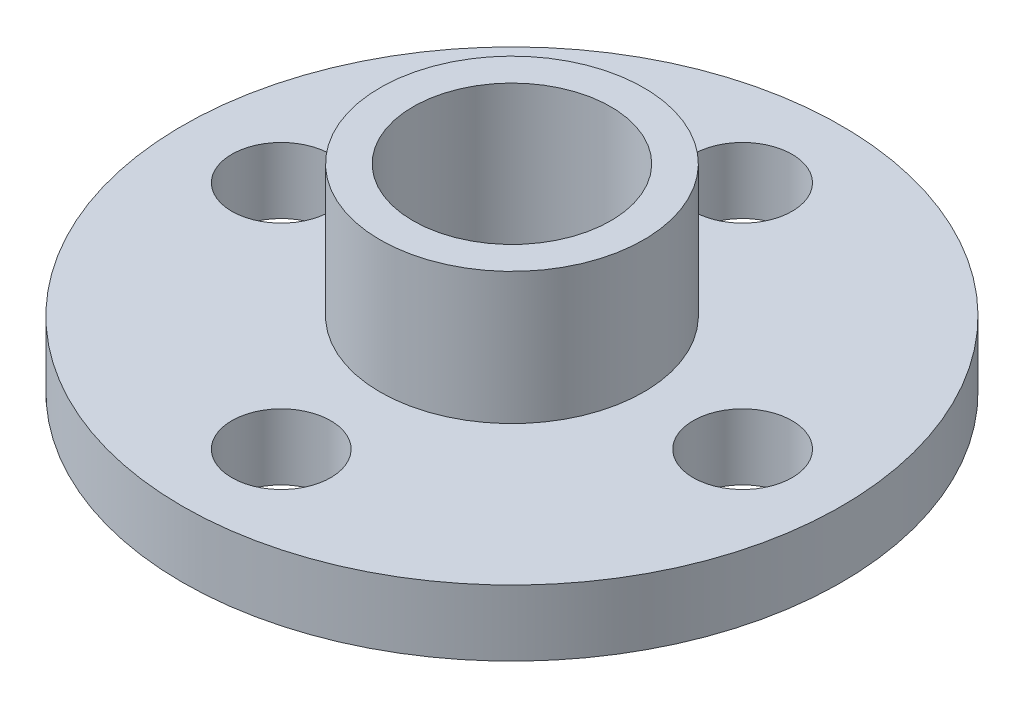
ISO-10303-21;
HEADER;
FILE_DESCRIPTION(('STEP AP214'),'2;1');
FILE_NAME('part.step','',(''),(''),'','','');
FILE_SCHEMA(('AUTOMOTIVE_DESIGN { 1 0 10303 214 1 1 1 1 }'));
ENDSEC;
DATA;
#1=APPLICATION_CONTEXT('core data for automotive mechanical design processes');
#2=APPLICATION_PROTOCOL_DEFINITION('international standard','automotive_design',2000,#1);
#3=PRODUCT_CONTEXT('',#1,'mechanical');
#4=PRODUCT('Part','Part','',(#3));
#5=PRODUCT_RELATED_PRODUCT_CATEGORY('part','',(#4));
#6=PRODUCT_DEFINITION_FORMATION('','',#4);
#7=PRODUCT_DEFINITION_CONTEXT('part definition',#1,'design');
#8=PRODUCT_DEFINITION('design','',#6,#7);
#9=PRODUCT_DEFINITION_SHAPE('','',#8);
#10=(LENGTH_UNIT() NAMED_UNIT(*) SI_UNIT(.MILLI.,.METRE.));
#11=(NAMED_UNIT(*) PLANE_ANGLE_UNIT() SI_UNIT($,.RADIAN.));
#12=(NAMED_UNIT(*) SI_UNIT($,.STERADIAN.) SOLID_ANGLE_UNIT());
#13=UNCERTAINTY_MEASURE_WITH_UNIT(LENGTH_MEASURE(1.E-05),#10,'distance_accuracy_value','');
#14=(GEOMETRIC_REPRESENTATION_CONTEXT(3) GLOBAL_UNCERTAINTY_ASSIGNED_CONTEXT((#13)) GLOBAL_UNIT_ASSIGNED_CONTEXT((#10,
#11,#12)) REPRESENTATION_CONTEXT('',''));
#15=CARTESIAN_POINT('',(0.,0.,0.));
#16=DIRECTION('',(0.,0.,1.));
#17=DIRECTION('',(1.,0.,0.));
#18=AXIS2_PLACEMENT_3D('',#15,#16,#17);
#19=CARTESIAN_POINT('',(0.,2.,0.));
#20=DIRECTION('',(0.,1.,0.));
#21=DIRECTION('',(0.,0.,1.));
#22=AXIS2_PLACEMENT_3D('',#19,#20,#21);
#23=PLANE('',#22);
#24=CARTESIAN_POINT('',(0.,2.,0.));
#25=DIRECTION('',(0.,1.,0.));
#26=DIRECTION('',(0.,0.,1.));
#27=AXIS2_PLACEMENT_3D('',#24,#25,#26);
#28=CIRCLE('',#27,4.);
#29=CARTESIAN_POINT('',(0.,2.,4.));
#30=VERTEX_POINT('',#29);
#31=EDGE_CURVE('E70',#30,#30,#28,.T.);
#32=ORIENTED_EDGE('',*,*,#31,.F.);
#33=EDGE_LOOP('',(#32));
#34=FACE_BOUND('',#33,.T.);
#35=CARTESIAN_POINT('',(4.23508953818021E-13,2.,7.));
#36=DIRECTION('',(0.,1.,0.));
#37=DIRECTION('',(0.,0.,1.));
#38=AXIS2_PLACEMENT_3D('',#35,#36,#37);
#39=CIRCLE('',#38,1.5);
#40=CARTESIAN_POINT('',(4.23508953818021E-13,2.,8.5));
#41=VERTEX_POINT('',#40);
#42=EDGE_CURVE('E55',#41,#41,#39,.T.);
#43=ORIENTED_EDGE('',*,*,#42,.F.);
#44=EDGE_LOOP('',(#43));
#45=FACE_BOUND('',#44,.T.);
#46=CARTESIAN_POINT('',(0.,2.,-7.));
#47=DIRECTION('',(0.,1.,0.));
#48=DIRECTION('',(0.,0.,1.));
#49=AXIS2_PLACEMENT_3D('',#46,#47,#48);
#50=CIRCLE('',#49,1.5);
#51=CARTESIAN_POINT('',(0.,2.,-5.5));
#52=VERTEX_POINT('',#51);
#53=EDGE_CURVE('E44',#52,#52,#50,.T.);
#54=ORIENTED_EDGE('',*,*,#53,.F.);
#55=EDGE_LOOP('',(#54));
#56=FACE_BOUND('',#55,.T.);
#57=CARTESIAN_POINT('',(0.,2.,0.));
#58=DIRECTION('',(0.,1.,0.));
#59=DIRECTION('',(0.,0.,1.));
#60=AXIS2_PLACEMENT_3D('',#57,#58,#59);
#61=CIRCLE('',#60,10.);
#62=CARTESIAN_POINT('',(0.,2.,10.));
#63=VERTEX_POINT('',#62);
#64=EDGE_CURVE('E10',#63,#63,#61,.T.);
#65=ORIENTED_EDGE('',*,*,#64,.T.);
#66=EDGE_LOOP('',(#65));
#67=FACE_BOUND('',#66,.T.);
#68=CARTESIAN_POINT('',(7.00000000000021,2.,-2.11754476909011E-13));
#69=DIRECTION('',(0.,1.,0.));
#70=DIRECTION('',(0.,0.,1.));
#71=AXIS2_PLACEMENT_3D('',#68,#69,#70);
#72=CIRCLE('',#71,1.5);
#73=CARTESIAN_POINT('',(7.00000000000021,2.,1.49999999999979));
#74=VERTEX_POINT('',#73);
#75=EDGE_CURVE('E49',#74,#74,#72,.T.);
#76=ORIENTED_EDGE('',*,*,#75,.F.);
#77=EDGE_LOOP('',(#76));
#78=FACE_BOUND('',#77,.T.);
#79=CARTESIAN_POINT('',(-6.99999999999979,2.,2.12611729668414E-13));
#80=DIRECTION('',(0.,1.,0.));
#81=DIRECTION('',(0.,0.,1.));
#82=AXIS2_PLACEMENT_3D('',#79,#80,#81);
#83=CIRCLE('',#82,1.5);
#84=CARTESIAN_POINT('',(-6.99999999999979,2.,1.50000000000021));
#85=VERTEX_POINT('',#84);
#86=EDGE_CURVE('E61',#85,#85,#83,.T.);
#87=ORIENTED_EDGE('',*,*,#86,.F.);
#88=EDGE_LOOP('',(#87));
#89=FACE_BOUND('',#88,.T.);
#90=ADVANCED_FACE('F31',(#34,#45,#56,#67,#78,#89),#23,.T.);
#91=CARTESIAN_POINT('',(0.,0.,0.));
#92=DIRECTION('',(0.,1.,0.));
#93=DIRECTION('',(0.,0.,1.));
#94=AXIS2_PLACEMENT_3D('',#91,#92,#93);
#95=PLANE('',#94);
#96=CARTESIAN_POINT('',(0.,0.,0.));
#97=DIRECTION('',(0.,1.,0.));
#98=DIRECTION('',(0.,0.,1.));
#99=AXIS2_PLACEMENT_3D('',#96,#97,#98);
#100=CIRCLE('',#99,3.);
#101=CARTESIAN_POINT('',(0.,0.,3.));
#102=VERTEX_POINT('',#101);
#103=EDGE_CURVE('E35',#102,#102,#100,.T.);
#104=ORIENTED_EDGE('',*,*,#103,.T.);
#105=EDGE_LOOP('',(#104));
#106=FACE_BOUND('',#105,.T.);
#107=CARTESIAN_POINT('',(0.,0.,0.));
#108=DIRECTION('',(0.,1.,0.));
#109=DIRECTION('',(0.,0.,1.));
#110=AXIS2_PLACEMENT_3D('',#107,#108,#109);
#111=CIRCLE('',#110,10.);
#112=CARTESIAN_POINT('',(0.,0.,10.));
#113=VERTEX_POINT('',#112);
#114=EDGE_CURVE('E39',#113,#113,#111,.T.);
#115=ORIENTED_EDGE('',*,*,#114,.F.);
#116=EDGE_LOOP('',(#115));
#117=FACE_BOUND('',#116,.T.);
#118=CARTESIAN_POINT('',(0.,0.,-7.));
#119=DIRECTION('',(0.,1.,0.));
#120=DIRECTION('',(0.,0.,1.));
#121=AXIS2_PLACEMENT_3D('',#118,#119,#120);
#122=CIRCLE('',#121,1.5);
#123=CARTESIAN_POINT('',(0.,0.,-5.5));
#124=VERTEX_POINT('',#123);
#125=EDGE_CURVE('E46',#124,#124,#122,.T.);
#126=ORIENTED_EDGE('',*,*,#125,.T.);
#127=EDGE_LOOP('',(#126));
#128=FACE_BOUND('',#127,.T.);
#129=CARTESIAN_POINT('',(7.00000000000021,0.,-2.11754476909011E-13));
#130=DIRECTION('',(0.,1.,0.));
#131=DIRECTION('',(0.,0.,1.));
#132=AXIS2_PLACEMENT_3D('',#129,#130,#131);
#133=CIRCLE('',#132,1.5);
#134=CARTESIAN_POINT('',(7.00000000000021,0.,1.49999999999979));
#135=VERTEX_POINT('',#134);
#136=EDGE_CURVE('E52',#135,#135,#133,.T.);
#137=ORIENTED_EDGE('',*,*,#136,.T.);
#138=EDGE_LOOP('',(#137));
#139=FACE_BOUND('',#138,.T.);
#140=CARTESIAN_POINT('',(4.23508953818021E-13,0.,7.));
#141=DIRECTION('',(0.,1.,0.));
#142=DIRECTION('',(0.,0.,1.));
#143=AXIS2_PLACEMENT_3D('',#140,#141,#142);
#144=CIRCLE('',#143,1.5);
#145=CARTESIAN_POINT('',(4.23508953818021E-13,0.,8.5));
#146=VERTEX_POINT('',#145);
#147=EDGE_CURVE('E58',#146,#146,#144,.T.);
#148=ORIENTED_EDGE('',*,*,#147,.T.);
#149=EDGE_LOOP('',(#148));
#150=FACE_BOUND('',#149,.T.);
#151=CARTESIAN_POINT('',(-6.99999999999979,0.,2.12611729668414E-13));
#152=DIRECTION('',(0.,1.,0.));
#153=DIRECTION('',(0.,0.,1.));
#154=AXIS2_PLACEMENT_3D('',#151,#152,#153);
#155=CIRCLE('',#154,1.5);
#156=CARTESIAN_POINT('',(-6.99999999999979,0.,1.50000000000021));
#157=VERTEX_POINT('',#156);
#158=EDGE_CURVE('E64',#157,#157,#155,.T.);
#159=ORIENTED_EDGE('',*,*,#158,.T.);
#160=EDGE_LOOP('',(#159));
#161=FACE_BOUND('',#160,.T.);
#162=ADVANCED_FACE('F82',(#106,#117,#128,#139,#150,#161),#95,.F.);
#163=CARTESIAN_POINT('',(0.,2.,0.));
#164=DIRECTION('',(0.,-1.,0.));
#165=DIRECTION('',(0.,0.,-1.));
#166=AXIS2_PLACEMENT_3D('',#163,#164,#165);
#167=CYLINDRICAL_SURFACE('',#166,10.);
#168=ORIENTED_EDGE('',*,*,#64,.F.);
#169=EDGE_LOOP('',(#168));
#170=FACE_BOUND('',#169,.T.);
#171=ORIENTED_EDGE('',*,*,#114,.T.);
#172=EDGE_LOOP('',(#171));
#173=FACE_BOUND('',#172,.T.);
#174=ADVANCED_FACE('F33',(#170,#173),#167,.T.);
#175=CARTESIAN_POINT('',(0.,2.,-7.));
#176=DIRECTION('',(0.,-1.,0.));
#177=DIRECTION('',(0.,0.,-1.));
#178=AXIS2_PLACEMENT_3D('',#175,#176,#177);
#179=CYLINDRICAL_SURFACE('',#178,1.5);
#180=ORIENTED_EDGE('',*,*,#53,.T.);
#181=EDGE_LOOP('',(#180));
#182=FACE_BOUND('',#181,.T.);
#183=ORIENTED_EDGE('',*,*,#125,.F.);
#184=EDGE_LOOP('',(#183));
#185=FACE_BOUND('',#184,.T.);
#186=ADVANCED_FACE('F105',(#182,#185),#179,.F.);
#187=CARTESIAN_POINT('',(7.00000000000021,2.,-2.11754476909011E-13));
#188=DIRECTION('',(0.,-1.,0.));
#189=DIRECTION('',(0.,0.,-1.));
#190=AXIS2_PLACEMENT_3D('',#187,#188,#189);
#191=CYLINDRICAL_SURFACE('',#190,1.5);
#192=ORIENTED_EDGE('',*,*,#75,.T.);
#193=EDGE_LOOP('',(#192));
#194=FACE_BOUND('',#193,.T.);
#195=ORIENTED_EDGE('',*,*,#136,.F.);
#196=EDGE_LOOP('',(#195));
#197=FACE_BOUND('',#196,.T.);
#198=ADVANCED_FACE('F108',(#194,#197),#191,.F.);
#199=CARTESIAN_POINT('',(4.23508953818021E-13,2.,7.));
#200=DIRECTION('',(0.,-1.,0.));
#201=DIRECTION('',(0.,0.,-1.));
#202=AXIS2_PLACEMENT_3D('',#199,#200,#201);
#203=CYLINDRICAL_SURFACE('',#202,1.5);
#204=ORIENTED_EDGE('',*,*,#42,.T.);
#205=EDGE_LOOP('',(#204));
#206=FACE_BOUND('',#205,.T.);
#207=ORIENTED_EDGE('',*,*,#147,.F.);
#208=EDGE_LOOP('',(#207));
#209=FACE_BOUND('',#208,.T.);
#210=ADVANCED_FACE('F112',(#206,#209),#203,.F.);
#211=CARTESIAN_POINT('',(-6.99999999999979,2.,2.12611729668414E-13));
#212=DIRECTION('',(0.,-1.,0.));
#213=DIRECTION('',(0.,0.,-1.));
#214=AXIS2_PLACEMENT_3D('',#211,#212,#213);
#215=CYLINDRICAL_SURFACE('',#214,1.5);
#216=ORIENTED_EDGE('',*,*,#86,.T.);
#217=EDGE_LOOP('',(#216));
#218=FACE_BOUND('',#217,.T.);
#219=ORIENTED_EDGE('',*,*,#158,.F.);
#220=EDGE_LOOP('',(#219));
#221=FACE_BOUND('',#220,.T.);
#222=ADVANCED_FACE('F116',(#218,#221),#215,.F.);
#223=CARTESIAN_POINT('',(0.,6.,0.));
#224=DIRECTION('',(0.,1.,0.));
#225=DIRECTION('',(0.,0.,1.));
#226=AXIS2_PLACEMENT_3D('',#223,#224,#225);
#227=PLANE('',#226);
#228=CARTESIAN_POINT('',(0.,6.,0.));
#229=DIRECTION('',(0.,1.,0.));
#230=DIRECTION('',(0.,0.,1.));
#231=AXIS2_PLACEMENT_3D('',#228,#229,#230);
#232=CIRCLE('',#231,4.);
#233=CARTESIAN_POINT('',(0.,6.,4.));
#234=VERTEX_POINT('',#233);
#235=EDGE_CURVE('E67',#234,#234,#232,.T.);
#236=ORIENTED_EDGE('',*,*,#235,.T.);
#237=EDGE_LOOP('',(#236));
#238=FACE_BOUND('',#237,.T.);
#239=CARTESIAN_POINT('',(0.,6.,0.));
#240=DIRECTION('',(0.,1.,0.));
#241=DIRECTION('',(0.,0.,1.));
#242=AXIS2_PLACEMENT_3D('',#239,#240,#241);
#243=CIRCLE('',#242,3.);
#244=CARTESIAN_POINT('',(0.,6.,3.));
#245=VERTEX_POINT('',#244);
#246=EDGE_CURVE('E73',#245,#245,#243,.T.);
#247=ORIENTED_EDGE('',*,*,#246,.F.);
#248=EDGE_LOOP('',(#247));
#249=FACE_BOUND('',#248,.T.);
#250=ADVANCED_FACE('F92',(#238,#249),#227,.T.);
#251=CARTESIAN_POINT('',(0.,6.,0.));
#252=DIRECTION('',(0.,-1.,0.));
#253=DIRECTION('',(0.,0.,-1.));
#254=AXIS2_PLACEMENT_3D('',#251,#252,#253);
#255=CYLINDRICAL_SURFACE('',#254,4.);
#256=ORIENTED_EDGE('',*,*,#235,.F.);
#257=EDGE_LOOP('',(#256));
#258=FACE_BOUND('',#257,.T.);
#259=ORIENTED_EDGE('',*,*,#31,.T.);
#260=EDGE_LOOP('',(#259));
#261=FACE_BOUND('',#260,.T.);
#262=ADVANCED_FACE('F87',(#258,#261),#255,.T.);
#263=CARTESIAN_POINT('',(0.,6.,0.));
#264=DIRECTION('',(0.,-1.,0.));
#265=DIRECTION('',(0.,0.,-1.));
#266=AXIS2_PLACEMENT_3D('',#263,#264,#265);
#267=CYLINDRICAL_SURFACE('',#266,3.);
#268=ORIENTED_EDGE('',*,*,#246,.T.);
#269=EDGE_LOOP('',(#268));
#270=FACE_BOUND('',#269,.T.);
#271=ORIENTED_EDGE('',*,*,#103,.F.);
#272=EDGE_LOOP('',(#271));
#273=FACE_BOUND('',#272,.T.);
#274=ADVANCED_FACE('F85',(#270,#273),#267,.F.);
#275=CLOSED_SHELL('',(#90,#162,#174,#186,#198,#210,#222,#250,#262,#274));
#276=MANIFOLD_SOLID_BREP('B2',#275);
#277=ADVANCED_BREP_SHAPE_REPRESENTATION('',(#18,#276),#14);
#278=SHAPE_DEFINITION_REPRESENTATION(#9,#277);
ENDSEC;
END-ISO-10303-21;
